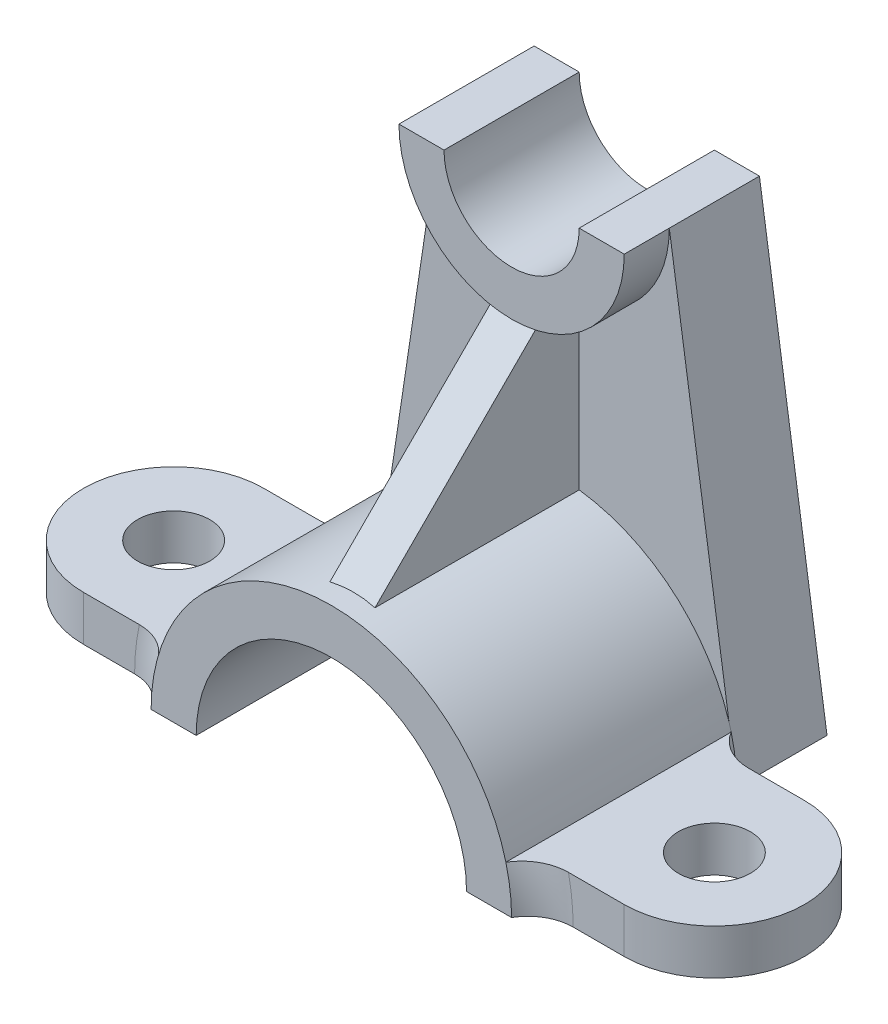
ISO-10303-21;
HEADER;
FILE_DESCRIPTION(('STEP AP214'),'2;1');
FILE_NAME('part.step','',(''),(''),'','','');
FILE_SCHEMA(('AUTOMOTIVE_DESIGN { 1 0 10303 214 1 1 1 1 }'));
ENDSEC;
DATA;
#1=APPLICATION_CONTEXT('core data for automotive mechanical design processes');
#2=APPLICATION_PROTOCOL_DEFINITION('international standard','automotive_design',2000,#1);
#3=PRODUCT_CONTEXT('',#1,'mechanical');
#4=PRODUCT('Part','Part','',(#3));
#5=PRODUCT_RELATED_PRODUCT_CATEGORY('part','',(#4));
#6=PRODUCT_DEFINITION_FORMATION('','',#4);
#7=PRODUCT_DEFINITION_CONTEXT('part definition',#1,'design');
#8=PRODUCT_DEFINITION('design','',#6,#7);
#9=PRODUCT_DEFINITION_SHAPE('','',#8);
#10=(LENGTH_UNIT() NAMED_UNIT(*) SI_UNIT(.MILLI.,.METRE.));
#11=(NAMED_UNIT(*) PLANE_ANGLE_UNIT() SI_UNIT($,.RADIAN.));
#12=(NAMED_UNIT(*) SI_UNIT($,.STERADIAN.) SOLID_ANGLE_UNIT());
#13=UNCERTAINTY_MEASURE_WITH_UNIT(LENGTH_MEASURE(1.E-05),#10,'distance_accuracy_value','');
#14=(GEOMETRIC_REPRESENTATION_CONTEXT(3) GLOBAL_UNCERTAINTY_ASSIGNED_CONTEXT((#13)) GLOBAL_UNIT_ASSIGNED_CONTEXT((#10,
#11,#12)) REPRESENTATION_CONTEXT('',''));
#15=CARTESIAN_POINT('',(0.,0.,0.));
#16=DIRECTION('',(0.,0.,1.));
#17=DIRECTION('',(1.,0.,0.));
#18=AXIS2_PLACEMENT_3D('',#15,#16,#17);
#19=CARTESIAN_POINT('',(-60.,10.,0.));
#20=DIRECTION('',(0.,1.,0.));
#21=DIRECTION('',(0.,0.,1.));
#22=AXIS2_PLACEMENT_3D('',#19,#20,#21);
#23=CYLINDRICAL_SURFACE('',#22,20.);
#24=DIRECTION('',(0.,1.,0.));
#25=VECTOR('',#24,1.);
#26=CARTESIAN_POINT('',(-60.,0.,20.));
#27=LINE('',#26,#25);
#28=CARTESIAN_POINT('',(-60.,10.,20.));
#29=VERTEX_POINT('',#28);
#30=CARTESIAN_POINT('',(-60.,0.,20.));
#31=VERTEX_POINT('',#30);
#32=EDGE_CURVE('E415',#29,#31,#27,.F.);
#33=ORIENTED_EDGE('',*,*,#32,.F.);
#34=CARTESIAN_POINT('',(-60.,10.,0.));
#35=DIRECTION('',(0.,1.,0.));
#36=DIRECTION('',(-1.,0.,0.));
#37=AXIS2_PLACEMENT_3D('',#34,#35,#36);
#38=CIRCLE('',#37,20.);
#39=CARTESIAN_POINT('',(-60.,10.,-20.));
#40=VERTEX_POINT('',#39);
#41=EDGE_CURVE('E421',#40,#29,#38,.T.);
#42=ORIENTED_EDGE('',*,*,#41,.F.);
#43=DIRECTION('',(0.,-1.,0.));
#44=VECTOR('',#43,1.);
#45=CARTESIAN_POINT('',(-60.,10.,-20.));
#46=LINE('',#45,#44);
#47=CARTESIAN_POINT('',(-60.,0.,-20.));
#48=VERTEX_POINT('',#47);
#49=EDGE_CURVE('E418',#48,#40,#46,.F.);
#50=ORIENTED_EDGE('',*,*,#49,.F.);
#51=CARTESIAN_POINT('',(-60.,0.,0.));
#52=DIRECTION('',(0.,1.,0.));
#53=DIRECTION('',(0.,0.,1.));
#54=AXIS2_PLACEMENT_3D('',#51,#52,#53);
#55=CIRCLE('',#54,20.);
#56=EDGE_CURVE('E423',#31,#48,#55,.F.);
#57=ORIENTED_EDGE('',*,*,#56,.F.);
#58=EDGE_LOOP('',(#33,#42,#50,#57));
#59=FACE_BOUND('',#58,.T.);
#60=ADVANCED_FACE('F34',(#59),#23,.T.);
#61=CARTESIAN_POINT('',(0.,100.,-25.));
#62=DIRECTION('',(0.,0.,-1.));
#63=DIRECTION('',(-1.,0.,0.));
#64=AXIS2_PLACEMENT_3D('',#61,#62,#63);
#65=PLANE('',#64);
#66=DIRECTION('',(0.,-1.,0.));
#67=VECTOR('',#66,1.);
#68=CARTESIAN_POINT('',(-5.,100.,-25.));
#69=LINE('',#68,#67);
#70=CARTESIAN_POINT('',(-5.,75.5051025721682,-25.));
#71=VERTEX_POINT('',#70);
#72=CARTESIAN_POINT('',(-5.,39.6862696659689,-25.));
#73=VERTEX_POINT('',#72);
#74=EDGE_CURVE('E215',#71,#73,#69,.T.);
#75=ORIENTED_EDGE('',*,*,#74,.F.);
#76=CARTESIAN_POINT('',(0.,100.,-25.));
#77=DIRECTION('',(0.,0.,1.));
#78=DIRECTION('',(-1.,0.,0.));
#79=AXIS2_PLACEMENT_3D('',#76,#77,#78);
#80=CIRCLE('',#79,25.);
#81=CARTESIAN_POINT('',(-25.,100.,-25.));
#82=VERTEX_POINT('',#81);
#83=EDGE_CURVE('E285',#82,#71,#80,.T.);
#84=ORIENTED_EDGE('',*,*,#83,.F.);
#85=DIRECTION('',(0.148340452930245,0.988936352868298,0.));
#86=VECTOR('',#85,1.);
#87=CARTESIAN_POINT('',(-40.,0.,-25.));
#88=LINE('',#87,#86);
#89=CARTESIAN_POINT('',(-38.239608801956,11.7359413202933,-25.));
#90=VERTEX_POINT('',#89);
#91=EDGE_CURVE('E296',#90,#82,#88,.T.);
#92=ORIENTED_EDGE('',*,*,#91,.F.);
#93=CARTESIAN_POINT('',(0.,0.,-25.));
#94=DIRECTION('',(0.,0.,-1.));
#95=DIRECTION('',(-1.,0.,0.));
#96=AXIS2_PLACEMENT_3D('',#93,#94,#95);
#97=CIRCLE('',#96,40.);
#98=EDGE_CURVE('E314',#90,#73,#97,.T.);
#99=ORIENTED_EDGE('',*,*,#98,.T.);
#100=EDGE_LOOP('',(#75,#84,#92,#99));
#101=FACE_BOUND('',#100,.T.);
#102=ADVANCED_FACE('F487',(#101),#65,.F.);
#103=CARTESIAN_POINT('',(0.,100.,-15.));
#104=DIRECTION('',(0.,0.,-1.));
#105=DIRECTION('',(-1.,0.,0.));
#106=AXIS2_PLACEMENT_3D('',#103,#104,#105);
#107=CYLINDRICAL_SURFACE('',#106,25.);
#108=DIRECTION('',(0.,0.,-1.));
#109=VECTOR('',#108,1.);
#110=CARTESIAN_POINT('',(5.,75.5051025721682,-15.));
#111=LINE('',#110,#109);
#112=CARTESIAN_POINT('',(5.,75.5051025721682,-25.));
#113=VERTEX_POINT('',#112);
#114=CARTESIAN_POINT('',(5.,75.5051025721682,-15.5051025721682));
#115=VERTEX_POINT('',#114);
#116=EDGE_CURVE('E219',#113,#115,#111,.F.);
#117=ORIENTED_EDGE('',*,*,#116,.F.);
#118=CARTESIAN_POINT('',(25.,100.,-25.));
#119=VERTEX_POINT('',#118);
#120=EDGE_CURVE('E300',#113,#119,#80,.T.);
#121=ORIENTED_EDGE('',*,*,#120,.T.);
#122=DIRECTION('',(0.,0.,-1.));
#123=VECTOR('',#122,1.);
#124=CARTESIAN_POINT('',(25.,100.,-15.));
#125=LINE('',#124,#123);
#126=CARTESIAN_POINT('',(25.,100.,-15.));
#127=VERTEX_POINT('',#126);
#128=EDGE_CURVE('E270',#127,#119,#125,.T.);
#129=ORIENTED_EDGE('',*,*,#128,.F.);
#130=CARTESIAN_POINT('',(0.,100.,-15.));
#131=DIRECTION('',(0.,0.,-1.));
#132=DIRECTION('',(-1.,0.,0.));
#133=AXIS2_PLACEMENT_3D('',#130,#131,#132);
#134=CIRCLE('',#133,25.);
#135=CARTESIAN_POINT('',(0.,75.,-15.));
#136=VERTEX_POINT('',#135);
#137=EDGE_CURVE('E250',#127,#136,#134,.T.);
#138=ORIENTED_EDGE('',*,*,#137,.T.);
#139=CARTESIAN_POINT('',(0.,100.,-40.));
#140=DIRECTION('',(0.,0.707106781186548,0.707106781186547));
#141=DIRECTION('',(0.,0.707106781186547,-0.707106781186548));
#142=AXIS2_PLACEMENT_3D('',#139,#140,#141);
#143=ELLIPSE('',#142,35.3553390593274,25.);
#144=EDGE_CURVE('E238',#115,#136,#143,.F.);
#145=ORIENTED_EDGE('',*,*,#144,.F.);
#146=EDGE_LOOP('',(#117,#121,#129,#138,#145));
#147=FACE_BOUND('',#146,.T.);
#148=ADVANCED_FACE('F478',(#147),#107,.T.);
#149=CARTESIAN_POINT('',(0.,0.,-25.));
#150=DIRECTION('',(0.,0.,1.));
#151=DIRECTION('',(1.,0.,0.));
#152=AXIS2_PLACEMENT_3D('',#149,#150,#151);
#153=PLANE('',#152);
#154=DIRECTION('',(0.148340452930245,-0.988936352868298,0.));
#155=VECTOR('',#154,1.);
#156=CARTESIAN_POINT('',(40.,0.,-25.));
#157=LINE('',#156,#155);
#158=CARTESIAN_POINT('',(38.239608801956,11.7359413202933,-25.));
#159=VERTEX_POINT('',#158);
#160=CARTESIAN_POINT('',(40.,0.,-25.));
#161=VERTEX_POINT('',#160);
#162=EDGE_CURVE('E273',#159,#161,#157,.T.);
#163=ORIENTED_EDGE('',*,*,#162,.F.);
#164=CARTESIAN_POINT('',(0.,0.,-25.));
#165=DIRECTION('',(0.,0.,1.));
#166=DIRECTION('',(1.,0.,0.));
#167=AXIS2_PLACEMENT_3D('',#164,#165,#166);
#168=CIRCLE('',#167,40.);
#169=CARTESIAN_POINT('',(38.7298334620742,10.,-25.));
#170=VERTEX_POINT('',#169);
#171=EDGE_CURVE('E352',#170,#159,#168,.T.);
#172=ORIENTED_EDGE('',*,*,#171,.F.);
#173=EDGE_CURVE('E348',#161,#170,#168,.T.);
#174=ORIENTED_EDGE('',*,*,#173,.F.);
#175=EDGE_LOOP('',(#163,#172,#174));
#176=FACE_BOUND('',#175,.T.);
#177=ADVANCED_FACE('F584',(#176),#153,.F.);
#178=CARTESIAN_POINT('',(-40.,0.,-25.));
#179=VERTEX_POINT('',#178);
#180=EDGE_CURVE('E297',#179,#90,#88,.T.);
#181=ORIENTED_EDGE('',*,*,#180,.F.);
#182=CARTESIAN_POINT('',(-38.7298334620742,10.,-25.));
#183=VERTEX_POINT('',#182);
#184=EDGE_CURVE('E334',#183,#179,#168,.T.);
#185=ORIENTED_EDGE('',*,*,#184,.F.);
#186=EDGE_CURVE('E553',#90,#183,#168,.T.);
#187=ORIENTED_EDGE('',*,*,#186,.F.);
#188=EDGE_LOOP('',(#181,#185,#187));
#189=FACE_BOUND('',#188,.T.);
#190=ADVANCED_FACE('F557',(#189),#153,.F.);
#191=CARTESIAN_POINT('',(60.,0.,0.));
#192=DIRECTION('',(0.,1.,0.));
#193=DIRECTION('',(0.,0.,1.));
#194=AXIS2_PLACEMENT_3D('',#191,#192,#193);
#195=CYLINDRICAL_SURFACE('',#194,20.);
#196=DIRECTION('',(0.,-1.,0.));
#197=VECTOR('',#196,1.);
#198=CARTESIAN_POINT('',(60.,0.,20.));
#199=LINE('',#198,#197);
#200=CARTESIAN_POINT('',(60.,0.,20.));
#201=VERTEX_POINT('',#200);
#202=CARTESIAN_POINT('',(60.,10.,20.));
#203=VERTEX_POINT('',#202);
#204=EDGE_CURVE('E359',#201,#203,#199,.F.);
#205=ORIENTED_EDGE('',*,*,#204,.F.);
#206=CARTESIAN_POINT('',(60.,0.,0.));
#207=DIRECTION('',(0.,1.,0.));
#208=DIRECTION('',(0.,0.,1.));
#209=AXIS2_PLACEMENT_3D('',#206,#207,#208);
#210=CIRCLE('',#209,20.);
#211=CARTESIAN_POINT('',(60.,0.,-20.));
#212=VERTEX_POINT('',#211);
#213=EDGE_CURVE('E365',#212,#201,#210,.F.);
#214=ORIENTED_EDGE('',*,*,#213,.F.);
#215=DIRECTION('',(0.,1.,0.));
#216=VECTOR('',#215,1.);
#217=CARTESIAN_POINT('',(60.,0.,-20.));
#218=LINE('',#217,#216);
#219=CARTESIAN_POINT('',(60.,10.,-20.));
#220=VERTEX_POINT('',#219);
#221=EDGE_CURVE('E362',#220,#212,#218,.F.);
#222=ORIENTED_EDGE('',*,*,#221,.F.);
#223=CARTESIAN_POINT('',(60.,10.,0.));
#224=DIRECTION('',(0.,-1.,0.));
#225=DIRECTION('',(1.,0.,0.));
#226=AXIS2_PLACEMENT_3D('',#223,#224,#225);
#227=CIRCLE('',#226,20.);
#228=EDGE_CURVE('E368',#203,#220,#227,.F.);
#229=ORIENTED_EDGE('',*,*,#228,.F.);
#230=EDGE_LOOP('',(#205,#214,#222,#229));
#231=FACE_BOUND('',#230,.T.);
#232=ADVANCED_FACE('F401',(#231),#195,.T.);
#233=CARTESIAN_POINT('',(0.,0.,25.));
#234=DIRECTION('',(0.,0.,-1.));
#235=DIRECTION('',(-1.,0.,0.));
#236=AXIS2_PLACEMENT_3D('',#233,#234,#235);
#237=CYLINDRICAL_SURFACE('',#236,40.);
#238=ORIENTED_EDGE('',*,*,#186,.T.);
#239=DIRECTION('',(0.,0.,-1.));
#240=VECTOR('',#239,1.);
#241=CARTESIAN_POINT('',(-38.7298334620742,10.,20.));
#242=LINE('',#241,#240);
#243=CARTESIAN_POINT('',(-38.7298334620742,10.,25.));
#244=VERTEX_POINT('',#243);
#245=EDGE_CURVE('E230',#244,#183,#242,.T.);
#246=ORIENTED_EDGE('',*,*,#245,.F.);
#247=CARTESIAN_POINT('',(0.,0.,25.));
#248=DIRECTION('',(0.,0.,1.));
#249=DIRECTION('',(1.,0.,0.));
#250=AXIS2_PLACEMENT_3D('',#247,#248,#249);
#251=CIRCLE('',#250,40.);
#252=CARTESIAN_POINT('',(38.7298334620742,10.,25.));
#253=VERTEX_POINT('',#252);
#254=EDGE_CURVE('E339',#253,#244,#251,.T.);
#255=ORIENTED_EDGE('',*,*,#254,.F.);
#256=DIRECTION('',(0.,0.,-1.));
#257=VECTOR('',#256,1.);
#258=CARTESIAN_POINT('',(38.7298334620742,10.,20.));
#259=LINE('',#258,#257);
#260=EDGE_CURVE('E329',#253,#170,#259,.T.);
#261=ORIENTED_EDGE('',*,*,#260,.T.);
#262=ORIENTED_EDGE('',*,*,#171,.T.);
#263=CARTESIAN_POINT('',(5.,39.6862696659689,-25.));
#264=VERTEX_POINT('',#263);
#265=EDGE_CURVE('E313',#264,#159,#97,.T.);
#266=ORIENTED_EDGE('',*,*,#265,.F.);
#267=DIRECTION('',(0.,0.,-1.));
#268=VECTOR('',#267,1.);
#269=CARTESIAN_POINT('',(5.,39.6862696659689,25.));
#270=LINE('',#269,#268);
#271=CARTESIAN_POINT('',(5.,39.6862696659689,20.3137303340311));
#272=VERTEX_POINT('',#271);
#273=EDGE_CURVE('E236',#264,#272,#270,.F.);
#274=ORIENTED_EDGE('',*,*,#273,.T.);
#275=CARTESIAN_POINT('',(0.,0.,60.));
#276=DIRECTION('',(0.,0.707106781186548,0.707106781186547));
#277=DIRECTION('',(0.,0.707106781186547,-0.707106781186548));
#278=AXIS2_PLACEMENT_3D('',#275,#276,#277);
#279=ELLIPSE('',#278,56.5685424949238,40.);
#280=CARTESIAN_POINT('',(-5.,39.6862696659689,20.3137303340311));
#281=VERTEX_POINT('',#280);
#282=EDGE_CURVE('E224',#272,#281,#279,.T.);
#283=ORIENTED_EDGE('',*,*,#282,.T.);
#284=DIRECTION('',(0.,0.,-1.));
#285=VECTOR('',#284,1.);
#286=CARTESIAN_POINT('',(-5.,39.6862696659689,25.));
#287=LINE('',#286,#285);
#288=EDGE_CURVE('E209',#73,#281,#287,.F.);
#289=ORIENTED_EDGE('',*,*,#288,.F.);
#290=ORIENTED_EDGE('',*,*,#98,.F.);
#291=EDGE_LOOP('',(#238,#246,#255,#261,#262,#266,#274,#283,#289,#290));
#292=FACE_BOUND('',#291,.T.);
#293=ADVANCED_FACE('F234',(#292),#237,.T.);
#294=CARTESIAN_POINT('',(0.,0.,25.));
#295=DIRECTION('',(0.,0.,-1.));
#296=DIRECTION('',(-1.,0.,0.));
#297=AXIS2_PLACEMENT_3D('',#294,#295,#296);
#298=CYLINDRICAL_SURFACE('',#297,30.);
#299=DIRECTION('',(0.,0.,-1.));
#300=VECTOR('',#299,1.);
#301=CARTESIAN_POINT('',(30.,0.,25.));
#302=LINE('',#301,#300);
#303=CARTESIAN_POINT('',(30.,0.,25.));
#304=VERTEX_POINT('',#303);
#305=CARTESIAN_POINT('',(30.,0.,-25.));
#306=VERTEX_POINT('',#305);
#307=EDGE_CURVE('E347',#304,#306,#302,.T.);
#308=ORIENTED_EDGE('',*,*,#307,.F.);
#309=CARTESIAN_POINT('',(0.,0.,25.));
#310=DIRECTION('',(0.,0.,-1.));
#311=DIRECTION('',(1.,0.,0.));
#312=AXIS2_PLACEMENT_3D('',#309,#310,#311);
#313=CIRCLE('',#312,30.);
#314=CARTESIAN_POINT('',(-30.,0.,25.));
#315=VERTEX_POINT('',#314);
#316=EDGE_CURVE('E342',#315,#304,#313,.T.);
#317=ORIENTED_EDGE('',*,*,#316,.F.);
#318=DIRECTION('',(0.,0.,-1.));
#319=VECTOR('',#318,1.);
#320=CARTESIAN_POINT('',(-30.,0.,25.));
#321=LINE('',#320,#319);
#322=CARTESIAN_POINT('',(-30.,0.,-25.));
#323=VERTEX_POINT('',#322);
#324=EDGE_CURVE('E356',#315,#323,#321,.T.);
#325=ORIENTED_EDGE('',*,*,#324,.T.);
#326=CARTESIAN_POINT('',(0.,0.,-25.));
#327=DIRECTION('',(0.,0.,-1.));
#328=DIRECTION('',(1.,0.,0.));
#329=AXIS2_PLACEMENT_3D('',#326,#327,#328);
#330=CIRCLE('',#329,30.);
#331=EDGE_CURVE('E351',#323,#306,#330,.T.);
#332=ORIENTED_EDGE('',*,*,#331,.T.);
#333=EDGE_LOOP('',(#308,#317,#325,#332));
#334=FACE_BOUND('',#333,.T.);
#335=ADVANCED_FACE('F598',(#334),#298,.F.);
#336=CARTESIAN_POINT('',(30.,0.,25.));
#337=DIRECTION('',(0.,1.,0.));
#338=DIRECTION('',(0.,0.,1.));
#339=AXIS2_PLACEMENT_3D('',#336,#337,#338);
#340=PLANE('',#339);
#341=CARTESIAN_POINT('',(-60.,0.,0.));
#342=DIRECTION('',(0.,-1.,0.));
#343=DIRECTION('',(1.,0.,0.));
#344=AXIS2_PLACEMENT_3D('',#341,#342,#343);
#345=CIRCLE('',#344,8.00000000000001);
#346=CARTESIAN_POINT('',(-52.,0.,0.));
#347=VERTEX_POINT('',#346);
#348=EDGE_CURVE('E530',#347,#347,#345,.T.);
#349=ORIENTED_EDGE('',*,*,#348,.F.);
#350=EDGE_LOOP('',(#349));
#351=FACE_BOUND('',#350,.T.);
#352=CARTESIAN_POINT('',(60.,0.,0.));
#353=DIRECTION('',(0.,1.,0.));
#354=DIRECTION('',(-1.,0.,0.));
#355=AXIS2_PLACEMENT_3D('',#352,#353,#354);
#356=CIRCLE('',#355,8.00000000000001);
#357=CARTESIAN_POINT('',(52.,0.,0.));
#358=VERTEX_POINT('',#357);
#359=EDGE_CURVE('E317',#358,#358,#356,.T.);
#360=ORIENTED_EDGE('',*,*,#359,.T.);
#361=EDGE_LOOP('',(#360));
#362=FACE_BOUND('',#361,.T.);
#363=DIRECTION('',(1.,0.,0.));
#364=VECTOR('',#363,1.);
#365=CARTESIAN_POINT('',(-40.,0.,25.));
#366=LINE('',#365,#364);
#367=CARTESIAN_POINT('',(-40.,0.,25.));
#368=VERTEX_POINT('',#367);
#369=EDGE_CURVE('E338',#368,#315,#366,.T.);
#370=ORIENTED_EDGE('',*,*,#369,.F.);
#371=CARTESIAN_POINT('',(-48.6602540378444,0.,30.));
#372=DIRECTION('',(0.,1.,0.));
#373=DIRECTION('',(0.,0.,1.));
#374=AXIS2_PLACEMENT_3D('',#371,#372,#373);
#375=CIRCLE('',#374,10.);
#376=CARTESIAN_POINT('',(-48.6602540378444,0.,20.));
#377=VERTEX_POINT('',#376);
#378=EDGE_CURVE('E48',#368,#377,#375,.T.);
#379=ORIENTED_EDGE('',*,*,#378,.T.);
#380=DIRECTION('',(-1.,0.,0.));
#381=VECTOR('',#380,1.);
#382=CARTESIAN_POINT('',(-40.,0.,20.));
#383=LINE('',#382,#381);
#384=EDGE_CURVE('E519',#377,#31,#383,.T.);
#385=ORIENTED_EDGE('',*,*,#384,.T.);
#386=ORIENTED_EDGE('',*,*,#56,.T.);
#387=DIRECTION('',(-1.,0.,0.));
#388=VECTOR('',#387,1.);
#389=CARTESIAN_POINT('',(-40.,0.,-20.));
#390=LINE('',#389,#388);
#391=CARTESIAN_POINT('',(-48.6602540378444,0.,-20.));
#392=VERTEX_POINT('',#391);
#393=EDGE_CURVE('E520',#392,#48,#390,.T.);
#394=ORIENTED_EDGE('',*,*,#393,.F.);
#395=CARTESIAN_POINT('',(-48.6602540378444,0.,-30.));
#396=DIRECTION('',(0.,1.,0.));
#397=DIRECTION('',(0.,0.,1.));
#398=AXIS2_PLACEMENT_3D('',#395,#396,#397);
#399=CIRCLE('',#398,10.);
#400=EDGE_CURVE('E430',#392,#179,#399,.T.);
#401=ORIENTED_EDGE('',*,*,#400,.T.);
#402=DIRECTION('',(0.,0.,1.));
#403=VECTOR('',#402,1.);
#404=CARTESIAN_POINT('',(-40.,0.,-45.));
#405=LINE('',#404,#403);
#406=CARTESIAN_POINT('',(-40.,0.,-45.));
#407=VERTEX_POINT('',#406);
#408=EDGE_CURVE('E307',#407,#179,#405,.T.);
#409=ORIENTED_EDGE('',*,*,#408,.F.);
#410=DIRECTION('',(-1.,0.,0.));
#411=VECTOR('',#410,1.);
#412=CARTESIAN_POINT('',(40.,0.,-45.));
#413=LINE('',#412,#411);
#414=CARTESIAN_POINT('',(40.,0.,-45.));
#415=VERTEX_POINT('',#414);
#416=EDGE_CURVE('E284',#415,#407,#413,.T.);
#417=ORIENTED_EDGE('',*,*,#416,.F.);
#418=DIRECTION('',(0.,0.,1.));
#419=VECTOR('',#418,1.);
#420=CARTESIAN_POINT('',(40.,0.,-45.));
#421=LINE('',#420,#419);
#422=EDGE_CURVE('E310',#415,#161,#421,.T.);
#423=ORIENTED_EDGE('',*,*,#422,.T.);
#424=CARTESIAN_POINT('',(48.6602540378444,0.,-30.));
#425=DIRECTION('',(0.,1.,0.));
#426=DIRECTION('',(0.,0.,1.));
#427=AXIS2_PLACEMENT_3D('',#424,#425,#426);
#428=CIRCLE('',#427,10.);
#429=CARTESIAN_POINT('',(48.6602540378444,0.,-20.));
#430=VERTEX_POINT('',#429);
#431=EDGE_CURVE('E375',#161,#430,#428,.T.);
#432=ORIENTED_EDGE('',*,*,#431,.T.);
#433=DIRECTION('',(1.,0.,0.));
#434=VECTOR('',#433,1.);
#435=CARTESIAN_POINT('',(40.,0.,-20.));
#436=LINE('',#435,#434);
#437=EDGE_CURVE('E320',#430,#212,#436,.T.);
#438=ORIENTED_EDGE('',*,*,#437,.T.);
#439=ORIENTED_EDGE('',*,*,#213,.T.);
#440=DIRECTION('',(1.,0.,0.));
#441=VECTOR('',#440,1.);
#442=CARTESIAN_POINT('',(40.,0.,20.));
#443=LINE('',#442,#441);
#444=CARTESIAN_POINT('',(48.6602540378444,0.,20.));
#445=VERTEX_POINT('',#444);
#446=EDGE_CURVE('E323',#445,#201,#443,.T.);
#447=ORIENTED_EDGE('',*,*,#446,.F.);
#448=CARTESIAN_POINT('',(48.6602540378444,0.,30.));
#449=DIRECTION('',(0.,1.,0.));
#450=DIRECTION('',(0.,0.,1.));
#451=AXIS2_PLACEMENT_3D('',#448,#449,#450);
#452=CIRCLE('',#451,10.);
#453=CARTESIAN_POINT('',(40.,0.,25.));
#454=VERTEX_POINT('',#453);
#455=EDGE_CURVE('E386',#445,#454,#452,.T.);
#456=ORIENTED_EDGE('',*,*,#455,.T.);
#457=DIRECTION('',(1.,0.,0.));
#458=VECTOR('',#457,1.);
#459=CARTESIAN_POINT('',(30.,0.,25.));
#460=LINE('',#459,#458);
#461=EDGE_CURVE('E344',#304,#454,#460,.T.);
#462=ORIENTED_EDGE('',*,*,#461,.F.);
#463=ORIENTED_EDGE('',*,*,#307,.T.);
#464=DIRECTION('',(-1.,0.,0.));
#465=VECTOR('',#464,1.);
#466=CARTESIAN_POINT('',(40.,0.,-25.));
#467=LINE('',#466,#465);
#468=EDGE_CURVE('E294',#306,#323,#467,.T.);
#469=ORIENTED_EDGE('',*,*,#468,.T.);
#470=ORIENTED_EDGE('',*,*,#324,.F.);
#471=EDGE_LOOP('',(#370,#379,#385,#386,#394,#401,#409,#417,#423,#432,#438,#439,#447,#456,#462,
#463,#469,#470));
#472=FACE_BOUND('',#471,.T.);
#473=ADVANCED_FACE('F565',(#351,#362,#472),#340,.F.);
#474=CARTESIAN_POINT('',(0.,0.,25.));
#475=DIRECTION('',(0.,0.,1.));
#476=DIRECTION('',(1.,0.,0.));
#477=AXIS2_PLACEMENT_3D('',#474,#475,#476);
#478=PLANE('',#477);
#479=ORIENTED_EDGE('',*,*,#316,.T.);
#480=ORIENTED_EDGE('',*,*,#461,.T.);
#481=EDGE_CURVE('E335',#454,#253,#251,.T.);
#482=ORIENTED_EDGE('',*,*,#481,.T.);
#483=ORIENTED_EDGE('',*,*,#254,.T.);
#484=EDGE_CURVE('E340',#244,#368,#251,.T.);
#485=ORIENTED_EDGE('',*,*,#484,.T.);
#486=ORIENTED_EDGE('',*,*,#369,.T.);
#487=EDGE_LOOP('',(#479,#480,#482,#483,#485,#486));
#488=FACE_BOUND('',#487,.T.);
#489=ADVANCED_FACE('F572',(#488),#478,.T.);
#490=CARTESIAN_POINT('',(80.,10.,20.));
#491=DIRECTION('',(0.,-1.,0.));
#492=DIRECTION('',(1.,0.,0.));
#493=AXIS2_PLACEMENT_3D('',#490,#491,#492);
#494=PLANE('',#493);
#495=CARTESIAN_POINT('',(60.,10.,0.));
#496=DIRECTION('',(0.,1.,0.));
#497=DIRECTION('',(-1.,0.,0.));
#498=AXIS2_PLACEMENT_3D('',#495,#496,#497);
#499=CIRCLE('',#498,8.00000000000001);
#500=CARTESIAN_POINT('',(52.,10.,0.));
#501=VERTEX_POINT('',#500);
#502=EDGE_CURVE('E316',#501,#501,#499,.T.);
#503=ORIENTED_EDGE('',*,*,#502,.F.);
#504=EDGE_LOOP('',(#503));
#505=FACE_BOUND('',#504,.T.);
#506=DIRECTION('',(-1.,0.,0.));
#507=VECTOR('',#506,1.);
#508=CARTESIAN_POINT('',(80.,10.,20.));
#509=LINE('',#508,#507);
#510=CARTESIAN_POINT('',(47.6216371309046,10.,20.));
#511=VERTEX_POINT('',#510);
#512=EDGE_CURVE('E325',#203,#511,#509,.T.);
#513=ORIENTED_EDGE('',*,*,#512,.F.);
#514=ORIENTED_EDGE('',*,*,#228,.T.);
#515=DIRECTION('',(-1.,0.,0.));
#516=VECTOR('',#515,1.);
#517=CARTESIAN_POINT('',(80.,10.,-20.));
#518=LINE('',#517,#516);
#519=CARTESIAN_POINT('',(47.6216371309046,10.,-20.));
#520=VERTEX_POINT('',#519);
#521=EDGE_CURVE('E326',#220,#520,#518,.T.);
#522=ORIENTED_EDGE('',*,*,#521,.T.);
#523=CARTESIAN_POINT('',(47.6216371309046,10.,-20.));
#524=CARTESIAN_POINT('',(47.3275635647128,10.,-19.9999725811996));
#525=CARTESIAN_POINT('',(47.0334977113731,10.,-20.01242289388));
#526=CARTESIAN_POINT('',(46.4474700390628,10.,-20.0620205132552));
#527=CARTESIAN_POINT('',(46.155508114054,10.,-20.0991665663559));
#528=CARTESIAN_POINT('',(45.5759581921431,10.,-20.1978612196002));
#529=CARTESIAN_POINT('',(45.2883671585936,10.,-20.2593919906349));
#530=CARTESIAN_POINT('',(44.7193773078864,10.,-20.4064113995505));
#531=CARTESIAN_POINT('',(44.4379784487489,10.,-20.4918998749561));
#532=CARTESIAN_POINT('',(43.883221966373,10.,-20.686310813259));
#533=CARTESIAN_POINT('',(43.6098688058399,10.,-20.7952460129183));
#534=CARTESIAN_POINT('',(43.0732082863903,10.,-21.0358552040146));
#535=CARTESIAN_POINT('',(42.809905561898,10.,-21.1675395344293));
#536=CARTESIAN_POINT('',(42.295507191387,10.,-21.4526919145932));
#537=CARTESIAN_POINT('',(42.0444066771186,10.,-21.6061511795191));
#538=CARTESIAN_POINT('',(41.5562899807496,10.,-21.9338095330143));
#539=CARTESIAN_POINT('',(41.319267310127,10.,-22.1079989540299));
#540=CARTESIAN_POINT('',(40.8558274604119,10.,-22.4801785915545));
#541=CARTESIAN_POINT('',(40.6297696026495,10.,-22.6786166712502));
#542=CARTESIAN_POINT('',(40.1960204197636,10.,-23.0946419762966));
#543=CARTESIAN_POINT('',(39.9883288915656,10.,-23.3122289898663));
#544=CARTESIAN_POINT('',(39.5925441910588,10.,-23.7656411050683));
#545=CARTESIAN_POINT('',(39.4045075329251,10.,-24.0015155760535));
#546=CARTESIAN_POINT('',(39.0503222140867,10.,-24.4892347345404));
#547=CARTESIAN_POINT('',(38.8841782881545,10.,-24.7410828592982));
#548=CARTESIAN_POINT('',(38.7298334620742,10.,-25.));
#549=B_SPLINE_CURVE_WITH_KNOTS('',3,(#523,#524,#525,#526,#527,#528,#529,#530,#531,#532,#533,
#534,#535,#536,#537,#538,#539,#540,#541,#542,#543,#544,#545,#546,#547,#548),.UNSPECIFIED.,.F.,
.F.,(4,2,2,2,2,2,2,2,2,2,2,2,4),(0.,0.881946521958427,1.76384827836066,2.64510641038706,
3.52635856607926,4.40809065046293,5.29022452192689,6.17200351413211,7.05337288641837,
7.95460227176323,8.85582169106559,9.75956497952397,10.6635034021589),.UNSPECIFIED.);
#550=EDGE_CURVE('E377',#520,#170,#549,.T.);
#551=ORIENTED_EDGE('',*,*,#550,.T.);
#552=ORIENTED_EDGE('',*,*,#260,.F.);
#553=CARTESIAN_POINT('',(38.7298334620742,10.,25.));
#554=CARTESIAN_POINT('',(38.8768130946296,10.,24.7534474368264));
#555=CARTESIAN_POINT('',(39.0344881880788,10.,24.5132998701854));
#556=CARTESIAN_POINT('',(39.3697661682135,10.,24.0474146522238));
#557=CARTESIAN_POINT('',(39.5473649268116,10.,23.821674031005));
#558=CARTESIAN_POINT('',(39.9206019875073,10.,23.3866670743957));
#559=CARTESIAN_POINT('',(40.1161920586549,10.,23.1773593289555));
#560=CARTESIAN_POINT('',(40.5242729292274,10.,22.7759168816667));
#561=CARTESIAN_POINT('',(40.7367642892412,10.,22.5837827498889));
#562=CARTESIAN_POINT('',(41.1769775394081,10.,22.2179742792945));
#563=CARTESIAN_POINT('',(41.4046951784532,10.,22.0442948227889));
#564=CARTESIAN_POINT('',(41.8738510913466,10.,21.7163510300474));
#565=CARTESIAN_POINT('',(42.1152953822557,10.,21.5620953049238));
#566=CARTESIAN_POINT('',(42.6102602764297,10.,21.2739519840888));
#567=CARTESIAN_POINT('',(42.8637887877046,10.,21.1400779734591));
#568=CARTESIAN_POINT('',(43.380892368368,10.,20.8937049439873));
#569=CARTESIAN_POINT('',(43.6444633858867,10.,20.7811974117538));
#570=CARTESIAN_POINT('',(44.2074399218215,10.,20.5677750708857));
#571=CARTESIAN_POINT('',(44.507748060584,10.,20.4692329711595));
#572=CARTESIAN_POINT('',(45.1160624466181,10.,20.2996699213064));
#573=CARTESIAN_POINT('',(45.4240695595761,10.,20.2286520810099));
#574=CARTESIAN_POINT('',(46.0457021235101,10.,20.1146504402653));
#575=CARTESIAN_POINT('',(46.3593351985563,10.,20.0717081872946));
#576=CARTESIAN_POINT('',(46.9891881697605,10.,20.0143649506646));
#577=CARTESIAN_POINT('',(47.3054079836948,10.,19.9999630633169));
#578=CARTESIAN_POINT('',(47.6216371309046,10.,20.));
#579=B_SPLINE_CURVE_WITH_KNOTS('',3,(#553,#554,#555,#556,#557,#558,#559,#560,#561,#562,#563,
#564,#565,#566,#567,#568,#569,#570,#571,#572,#573,#574,#575,#576,#577,#578),.UNSPECIFIED.,.F.,
.F.,(4,2,2,2,2,2,2,2,2,2,2,2,4),(0.,0.860812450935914,1.72144687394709,2.57983785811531,
3.43825732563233,4.29643811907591,5.15499803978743,6.01412773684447,6.87291439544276,
7.81978670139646,8.76676595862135,9.71514344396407,10.663490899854),.UNSPECIFIED.);
#580=EDGE_CURVE('E409',#253,#511,#579,.T.);
#581=ORIENTED_EDGE('',*,*,#580,.T.);
#582=EDGE_LOOP('',(#513,#514,#522,#551,#552,#581));
#583=FACE_BOUND('',#582,.T.);
#584=ADVANCED_FACE('F388',(#505,#583),#494,.F.);
#585=CARTESIAN_POINT('',(0.,0.,20.));
#586=DIRECTION('',(0.,0.,1.));
#587=DIRECTION('',(1.,0.,0.));
#588=AXIS2_PLACEMENT_3D('',#585,#586,#587);
#589=PLANE('',#588);
#590=ORIENTED_EDGE('',*,*,#512,.T.);
#591=CARTESIAN_POINT('',(0.,0.,20.));
#592=DIRECTION('',(0.,0.,1.));
#593=DIRECTION('',(1.,0.,0.));
#594=AXIS2_PLACEMENT_3D('',#591,#592,#593);
#595=CIRCLE('',#594,48.6602540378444);
#596=EDGE_CURVE('E372',#511,#445,#595,.F.);
#597=ORIENTED_EDGE('',*,*,#596,.T.);
#598=ORIENTED_EDGE('',*,*,#446,.T.);
#599=ORIENTED_EDGE('',*,*,#204,.T.);
#600=EDGE_LOOP('',(#590,#597,#598,#599));
#601=FACE_BOUND('',#600,.T.);
#602=ADVANCED_FACE('F499',(#601),#589,.T.);
#603=CARTESIAN_POINT('',(0.,0.,-20.));
#604=DIRECTION('',(0.,0.,1.));
#605=DIRECTION('',(1.,0.,0.));
#606=AXIS2_PLACEMENT_3D('',#603,#604,#605);
#607=PLANE('',#606);
#608=ORIENTED_EDGE('',*,*,#437,.F.);
#609=CARTESIAN_POINT('',(0.,0.,-20.));
#610=DIRECTION('',(0.,0.,1.));
#611=DIRECTION('',(1.,0.,0.));
#612=AXIS2_PLACEMENT_3D('',#609,#610,#611);
#613=CIRCLE('',#612,48.6602540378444);
#614=EDGE_CURVE('E370',#430,#520,#613,.T.);
#615=ORIENTED_EDGE('',*,*,#614,.T.);
#616=ORIENTED_EDGE('',*,*,#521,.F.);
#617=ORIENTED_EDGE('',*,*,#221,.T.);
#618=EDGE_LOOP('',(#608,#615,#616,#617));
#619=FACE_BOUND('',#618,.T.);
#620=ADVANCED_FACE('F398',(#619),#607,.F.);
#621=CARTESIAN_POINT('',(0.,0.,-30.));
#622=DIRECTION('',(0.,0.,1.));
#623=DIRECTION('',(1.,0.,0.));
#624=AXIS2_PLACEMENT_3D('',#621,#622,#623);
#625=TOROIDAL_SURFACE('',#624,48.6602540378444,10.);
#626=ORIENTED_EDGE('',*,*,#550,.F.);
#627=ORIENTED_EDGE('',*,*,#614,.F.);
#628=ORIENTED_EDGE('',*,*,#431,.F.);
#629=ORIENTED_EDGE('',*,*,#173,.T.);
#630=EDGE_LOOP('',(#626,#627,#628,#629));
#631=FACE_BOUND('',#630,.T.);
#632=ADVANCED_FACE('F392',(#631),#625,.F.);
#633=CARTESIAN_POINT('',(0.,0.,30.));
#634=DIRECTION('',(0.,0.,1.));
#635=DIRECTION('',(1.,0.,0.));
#636=AXIS2_PLACEMENT_3D('',#633,#634,#635);
#637=TOROIDAL_SURFACE('',#636,48.6602540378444,10.);
#638=ORIENTED_EDGE('',*,*,#580,.F.);
#639=ORIENTED_EDGE('',*,*,#481,.F.);
#640=ORIENTED_EDGE('',*,*,#455,.F.);
#641=ORIENTED_EDGE('',*,*,#596,.F.);
#642=EDGE_LOOP('',(#638,#639,#640,#641));
#643=FACE_BOUND('',#642,.T.);
#644=ADVANCED_FACE('F397',(#643),#637,.F.);
#645=CARTESIAN_POINT('',(60.,0.,0.));
#646=DIRECTION('',(0.,1.,0.));
#647=DIRECTION('',(-1.,0.,0.));
#648=AXIS2_PLACEMENT_3D('',#645,#646,#647);
#649=CYLINDRICAL_SURFACE('',#648,8.00000000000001);
#650=ORIENTED_EDGE('',*,*,#359,.F.);
#651=EDGE_LOOP('',(#650));
#652=FACE_BOUND('',#651,.T.);
#653=ORIENTED_EDGE('',*,*,#502,.T.);
#654=EDGE_LOOP('',(#653));
#655=FACE_BOUND('',#654,.T.);
#656=ADVANCED_FACE('F406',(#652,#655),#649,.F.);
#657=ORIENTED_EDGE('',*,*,#120,.F.);
#658=DIRECTION('',(0.,-1.,0.));
#659=VECTOR('',#658,1.);
#660=CARTESIAN_POINT('',(5.,100.,-25.));
#661=LINE('',#660,#659);
#662=EDGE_CURVE('E245',#113,#264,#661,.T.);
#663=ORIENTED_EDGE('',*,*,#662,.T.);
#664=ORIENTED_EDGE('',*,*,#265,.T.);
#665=EDGE_CURVE('E291',#119,#159,#157,.T.);
#666=ORIENTED_EDGE('',*,*,#665,.F.);
#667=EDGE_LOOP('',(#657,#663,#664,#666));
#668=FACE_BOUND('',#667,.T.);
#669=ADVANCED_FACE('F488',(#668),#65,.F.);
#670=CARTESIAN_POINT('',(40.,0.,-45.));
#671=DIRECTION('',(-0.988936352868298,-0.148340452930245,0.));
#672=DIRECTION('',(0.148340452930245,-0.988936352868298,0.));
#673=AXIS2_PLACEMENT_3D('',#670,#671,#672);
#674=PLANE('',#673);
#675=ORIENTED_EDGE('',*,*,#665,.T.);
#676=ORIENTED_EDGE('',*,*,#162,.T.);
#677=ORIENTED_EDGE('',*,*,#422,.F.);
#678=DIRECTION('',(0.148340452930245,-0.988936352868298,0.));
#679=VECTOR('',#678,1.);
#680=CARTESIAN_POINT('',(40.,0.,-45.));
#681=LINE('',#680,#679);
#682=CARTESIAN_POINT('',(25.,100.,-45.));
#683=VERTEX_POINT('',#682);
#684=EDGE_CURVE('E281',#683,#415,#681,.T.);
#685=ORIENTED_EDGE('',*,*,#684,.F.);
#686=DIRECTION('',(0.,0.,1.));
#687=VECTOR('',#686,1.);
#688=CARTESIAN_POINT('',(25.,100.,-45.));
#689=LINE('',#688,#687);
#690=EDGE_CURVE('E290',#683,#119,#689,.T.);
#691=ORIENTED_EDGE('',*,*,#690,.T.);
#692=EDGE_LOOP('',(#675,#676,#677,#685,#691));
#693=FACE_BOUND('',#692,.T.);
#694=ADVANCED_FACE('F491',(#693),#674,.F.);
#695=CARTESIAN_POINT('',(-40.,0.,-45.));
#696=DIRECTION('',(0.988936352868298,-0.148340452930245,0.));
#697=DIRECTION('',(0.148340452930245,0.988936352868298,0.));
#698=AXIS2_PLACEMENT_3D('',#695,#696,#697);
#699=PLANE('',#698);
#700=ORIENTED_EDGE('',*,*,#180,.T.);
#701=ORIENTED_EDGE('',*,*,#91,.T.);
#702=DIRECTION('',(0.,0.,1.));
#703=VECTOR('',#702,1.);
#704=CARTESIAN_POINT('',(-25.,100.,-45.));
#705=LINE('',#704,#703);
#706=CARTESIAN_POINT('',(-25.,100.,-45.));
#707=VERTEX_POINT('',#706);
#708=EDGE_CURVE('E305',#707,#82,#705,.T.);
#709=ORIENTED_EDGE('',*,*,#708,.F.);
#710=DIRECTION('',(0.148340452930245,0.988936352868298,0.));
#711=VECTOR('',#710,1.);
#712=CARTESIAN_POINT('',(-40.,0.,-45.));
#713=LINE('',#712,#711);
#714=EDGE_CURVE('E287',#407,#707,#713,.T.);
#715=ORIENTED_EDGE('',*,*,#714,.F.);
#716=ORIENTED_EDGE('',*,*,#408,.T.);
#717=EDGE_LOOP('',(#700,#701,#709,#715,#716));
#718=FACE_BOUND('',#717,.T.);
#719=ADVANCED_FACE('F482',(#718),#699,.F.);
#720=CARTESIAN_POINT('',(0.,100.,-45.));
#721=DIRECTION('',(0.,0.,-1.));
#722=DIRECTION('',(-1.,0.,0.));
#723=AXIS2_PLACEMENT_3D('',#720,#721,#722);
#724=PLANE('',#723);
#725=ORIENTED_EDGE('',*,*,#416,.T.);
#726=ORIENTED_EDGE('',*,*,#714,.T.);
#727=DIRECTION('',(1.,0.,0.));
#728=VECTOR('',#727,1.);
#729=CARTESIAN_POINT('',(-15.,100.,-45.));
#730=LINE('',#729,#728);
#731=CARTESIAN_POINT('',(-15.,100.,-45.));
#732=VERTEX_POINT('',#731);
#733=EDGE_CURVE('E249',#707,#732,#730,.T.);
#734=ORIENTED_EDGE('',*,*,#733,.T.);
#735=CARTESIAN_POINT('',(0.,100.,-45.));
#736=DIRECTION('',(0.,0.,1.));
#737=DIRECTION('',(-1.,0.,0.));
#738=AXIS2_PLACEMENT_3D('',#735,#736,#737);
#739=CIRCLE('',#738,15.);
#740=CARTESIAN_POINT('',(15.,100.,-45.));
#741=VERTEX_POINT('',#740);
#742=EDGE_CURVE('E266',#732,#741,#739,.T.);
#743=ORIENTED_EDGE('',*,*,#742,.T.);
#744=DIRECTION('',(1.,0.,0.));
#745=VECTOR('',#744,1.);
#746=CARTESIAN_POINT('',(25.,100.,-45.));
#747=LINE('',#746,#745);
#748=EDGE_CURVE('E268',#741,#683,#747,.T.);
#749=ORIENTED_EDGE('',*,*,#748,.T.);
#750=ORIENTED_EDGE('',*,*,#684,.T.);
#751=EDGE_LOOP('',(#725,#726,#734,#743,#749,#750));
#752=FACE_BOUND('',#751,.T.);
#753=ADVANCED_FACE('F479',(#752),#724,.T.);
#754=ORIENTED_EDGE('',*,*,#468,.F.);
#755=ORIENTED_EDGE('',*,*,#331,.F.);
#756=EDGE_LOOP('',(#754,#755));
#757=FACE_BOUND('',#756,.T.);
#758=ADVANCED_FACE('F476',(#757),#65,.F.);
#759=CARTESIAN_POINT('',(-5.,75.5051025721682,-15.5051025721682));
#760=VERTEX_POINT('',#759);
#761=EDGE_CURVE('E227',#136,#760,#143,.F.);
#762=ORIENTED_EDGE('',*,*,#761,.F.);
#763=CARTESIAN_POINT('',(-25.,100.,-15.));
#764=VERTEX_POINT('',#763);
#765=EDGE_CURVE('E254',#136,#764,#134,.T.);
#766=ORIENTED_EDGE('',*,*,#765,.T.);
#767=DIRECTION('',(0.,0.,-1.));
#768=VECTOR('',#767,1.);
#769=CARTESIAN_POINT('',(-25.,100.,-15.));
#770=LINE('',#769,#768);
#771=EDGE_CURVE('E263',#764,#82,#770,.T.);
#772=ORIENTED_EDGE('',*,*,#771,.T.);
#773=ORIENTED_EDGE('',*,*,#83,.T.);
#774=DIRECTION('',(0.,0.,-1.));
#775=VECTOR('',#774,1.);
#776=CARTESIAN_POINT('',(-5.,75.5051025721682,-15.));
#777=LINE('',#776,#775);
#778=EDGE_CURVE('E237',#71,#760,#777,.F.);
#779=ORIENTED_EDGE('',*,*,#778,.T.);
#780=EDGE_LOOP('',(#762,#766,#772,#773,#779));
#781=FACE_BOUND('',#780,.T.);
#782=ADVANCED_FACE('F466',(#781),#107,.T.);
#783=CARTESIAN_POINT('',(25.,100.,-15.));
#784=DIRECTION('',(0.,1.,0.));
#785=DIRECTION('',(0.,0.,1.));
#786=AXIS2_PLACEMENT_3D('',#783,#784,#785);
#787=PLANE('',#786);
#788=ORIENTED_EDGE('',*,*,#748,.F.);
#789=DIRECTION('',(0.,0.,-1.));
#790=VECTOR('',#789,1.);
#791=CARTESIAN_POINT('',(15.,100.,-15.));
#792=LINE('',#791,#790);
#793=CARTESIAN_POINT('',(15.,100.,-15.));
#794=VERTEX_POINT('',#793);
#795=EDGE_CURVE('E274',#794,#741,#792,.T.);
#796=ORIENTED_EDGE('',*,*,#795,.F.);
#797=DIRECTION('',(1.,0.,0.));
#798=VECTOR('',#797,1.);
#799=CARTESIAN_POINT('',(25.,100.,-15.));
#800=LINE('',#799,#798);
#801=EDGE_CURVE('E260',#794,#127,#800,.T.);
#802=ORIENTED_EDGE('',*,*,#801,.T.);
#803=ORIENTED_EDGE('',*,*,#128,.T.);
#804=ORIENTED_EDGE('',*,*,#690,.F.);
#805=EDGE_LOOP('',(#788,#796,#802,#803,#804));
#806=FACE_BOUND('',#805,.T.);
#807=ADVANCED_FACE('F462',(#806),#787,.T.);
#808=CARTESIAN_POINT('',(0.,100.,-15.));
#809=DIRECTION('',(0.,0.,-1.));
#810=DIRECTION('',(-1.,0.,0.));
#811=AXIS2_PLACEMENT_3D('',#808,#809,#810);
#812=CYLINDRICAL_SURFACE('',#811,15.);
#813=ORIENTED_EDGE('',*,*,#795,.T.);
#814=ORIENTED_EDGE('',*,*,#742,.F.);
#815=DIRECTION('',(0.,0.,-1.));
#816=VECTOR('',#815,1.);
#817=CARTESIAN_POINT('',(-15.,100.,-15.));
#818=LINE('',#817,#816);
#819=CARTESIAN_POINT('',(-15.,100.,-15.));
#820=VERTEX_POINT('',#819);
#821=EDGE_CURVE('E277',#820,#732,#818,.T.);
#822=ORIENTED_EDGE('',*,*,#821,.F.);
#823=CARTESIAN_POINT('',(0.,100.,-15.));
#824=DIRECTION('',(0.,0.,1.));
#825=DIRECTION('',(-1.,0.,0.));
#826=AXIS2_PLACEMENT_3D('',#823,#824,#825);
#827=CIRCLE('',#826,15.);
#828=EDGE_CURVE('E257',#820,#794,#827,.T.);
#829=ORIENTED_EDGE('',*,*,#828,.T.);
#830=EDGE_LOOP('',(#813,#814,#822,#829));
#831=FACE_BOUND('',#830,.T.);
#832=ADVANCED_FACE('F465',(#831),#812,.F.);
#833=CARTESIAN_POINT('',(-15.,100.,-15.));
#834=DIRECTION('',(0.,1.,0.));
#835=DIRECTION('',(0.,0.,1.));
#836=AXIS2_PLACEMENT_3D('',#833,#834,#835);
#837=PLANE('',#836);
#838=ORIENTED_EDGE('',*,*,#733,.F.);
#839=ORIENTED_EDGE('',*,*,#708,.T.);
#840=ORIENTED_EDGE('',*,*,#771,.F.);
#841=DIRECTION('',(1.,0.,0.));
#842=VECTOR('',#841,1.);
#843=CARTESIAN_POINT('',(-15.,100.,-15.));
#844=LINE('',#843,#842);
#845=EDGE_CURVE('E253',#764,#820,#844,.T.);
#846=ORIENTED_EDGE('',*,*,#845,.T.);
#847=ORIENTED_EDGE('',*,*,#821,.T.);
#848=EDGE_LOOP('',(#838,#839,#840,#846,#847));
#849=FACE_BOUND('',#848,.T.);
#850=ADVANCED_FACE('F460',(#849),#837,.T.);
#851=CARTESIAN_POINT('',(0.,100.,-15.));
#852=DIRECTION('',(0.,0.,-1.));
#853=DIRECTION('',(-1.,0.,0.));
#854=AXIS2_PLACEMENT_3D('',#851,#852,#853);
#855=PLANE('',#854);
#856=ORIENTED_EDGE('',*,*,#137,.F.);
#857=ORIENTED_EDGE('',*,*,#801,.F.);
#858=ORIENTED_EDGE('',*,*,#828,.F.);
#859=ORIENTED_EDGE('',*,*,#845,.F.);
#860=ORIENTED_EDGE('',*,*,#765,.F.);
#861=EDGE_LOOP('',(#856,#857,#858,#859,#860));
#862=FACE_BOUND('',#861,.T.);
#863=ADVANCED_FACE('F452',(#862),#855,.F.);
#864=CARTESIAN_POINT('',(5.,50.,-9.66015402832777));
#865=DIRECTION('',(1.,0.,0.));
#866=DIRECTION('',(0.,0.,-1.));
#867=AXIS2_PLACEMENT_3D('',#864,#865,#866);
#868=PLANE('',#867);
#869=ORIENTED_EDGE('',*,*,#273,.F.);
#870=ORIENTED_EDGE('',*,*,#662,.F.);
#871=ORIENTED_EDGE('',*,*,#116,.T.);
#872=DIRECTION('',(0.,-0.707106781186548,0.707106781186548));
#873=VECTOR('',#872,1.);
#874=CARTESIAN_POINT('',(5.,75.,-15.));
#875=LINE('',#874,#873);
#876=EDGE_CURVE('E229',#115,#272,#875,.T.);
#877=ORIENTED_EDGE('',*,*,#876,.T.);
#878=EDGE_LOOP('',(#869,#870,#871,#877));
#879=FACE_BOUND('',#878,.T.);
#880=ADVANCED_FACE('F448',(#879),#868,.T.);
#881=CARTESIAN_POINT('',(-5.,50.,-9.66015402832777));
#882=DIRECTION('',(1.,0.,0.));
#883=DIRECTION('',(0.,0.,-1.));
#884=AXIS2_PLACEMENT_3D('',#881,#882,#883);
#885=PLANE('',#884);
#886=ORIENTED_EDGE('',*,*,#74,.T.);
#887=ORIENTED_EDGE('',*,*,#288,.T.);
#888=DIRECTION('',(0.,-0.707106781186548,0.707106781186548));
#889=VECTOR('',#888,1.);
#890=CARTESIAN_POINT('',(-5.,75.,-15.));
#891=LINE('',#890,#889);
#892=EDGE_CURVE('E212',#760,#281,#891,.T.);
#893=ORIENTED_EDGE('',*,*,#892,.F.);
#894=ORIENTED_EDGE('',*,*,#778,.F.);
#895=EDGE_LOOP('',(#886,#887,#893,#894));
#896=FACE_BOUND('',#895,.T.);
#897=ADVANCED_FACE('F211',(#896),#885,.F.);
#898=CARTESIAN_POINT('',(0.,75.,-15.));
#899=DIRECTION('',(0.,0.707106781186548,0.707106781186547));
#900=DIRECTION('',(0.,-0.707106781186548,0.707106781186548));
#901=AXIS2_PLACEMENT_3D('',#898,#899,#900);
#902=PLANE('',#901);
#903=ORIENTED_EDGE('',*,*,#282,.F.);
#904=ORIENTED_EDGE('',*,*,#876,.F.);
#905=ORIENTED_EDGE('',*,*,#144,.T.);
#906=ORIENTED_EDGE('',*,*,#761,.T.);
#907=ORIENTED_EDGE('',*,*,#892,.T.);
#908=EDGE_LOOP('',(#903,#904,#905,#906,#907));
#909=FACE_BOUND('',#908,.T.);
#910=ADVANCED_FACE('F222',(#909),#902,.T.);
#911=CARTESIAN_POINT('',(-80.,10.,20.));
#912=DIRECTION('',(0.,1.,0.));
#913=DIRECTION('',(-1.,0.,0.));
#914=AXIS2_PLACEMENT_3D('',#911,#912,#913);
#915=PLANE('',#914);
#916=CARTESIAN_POINT('',(-60.,10.,0.));
#917=DIRECTION('',(0.,-1.,0.));
#918=DIRECTION('',(1.,0.,0.));
#919=AXIS2_PLACEMENT_3D('',#916,#917,#918);
#920=CIRCLE('',#919,8.00000000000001);
#921=CARTESIAN_POINT('',(-52.,10.,0.));
#922=VERTEX_POINT('',#921);
#923=EDGE_CURVE('E526',#922,#922,#920,.T.);
#924=ORIENTED_EDGE('',*,*,#923,.T.);
#925=EDGE_LOOP('',(#924));
#926=FACE_BOUND('',#925,.T.);
#927=DIRECTION('',(1.,0.,0.));
#928=VECTOR('',#927,1.);
#929=CARTESIAN_POINT('',(-80.,10.,-20.));
#930=LINE('',#929,#928);
#931=CARTESIAN_POINT('',(-47.6216371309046,10.,-20.));
#932=VERTEX_POINT('',#931);
#933=EDGE_CURVE('E523',#40,#932,#930,.T.);
#934=ORIENTED_EDGE('',*,*,#933,.F.);
#935=ORIENTED_EDGE('',*,*,#41,.T.);
#936=DIRECTION('',(1.,0.,0.));
#937=VECTOR('',#936,1.);
#938=CARTESIAN_POINT('',(-80.,10.,20.));
#939=LINE('',#938,#937);
#940=CARTESIAN_POINT('',(-47.6216371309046,10.,20.));
#941=VERTEX_POINT('',#940);
#942=EDGE_CURVE('E516',#29,#941,#939,.T.);
#943=ORIENTED_EDGE('',*,*,#942,.T.);
#944=CARTESIAN_POINT('',(-47.6216371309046,10.,20.));
#945=CARTESIAN_POINT('',(-47.3275635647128,10.,19.9999725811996));
#946=CARTESIAN_POINT('',(-47.0334977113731,10.,20.01242289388));
#947=CARTESIAN_POINT('',(-46.4474700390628,10.,20.0620205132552));
#948=CARTESIAN_POINT('',(-46.155508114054,10.,20.0991665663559));
#949=CARTESIAN_POINT('',(-45.5759581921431,10.,20.1978612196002));
#950=CARTESIAN_POINT('',(-45.2883671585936,10.,20.2593919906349));
#951=CARTESIAN_POINT('',(-44.7193773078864,10.,20.4064113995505));
#952=CARTESIAN_POINT('',(-44.4379784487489,10.,20.4918998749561));
#953=CARTESIAN_POINT('',(-43.883221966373,10.,20.686310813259));
#954=CARTESIAN_POINT('',(-43.6098688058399,10.,20.7952460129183));
#955=CARTESIAN_POINT('',(-43.0732082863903,10.,21.0358552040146));
#956=CARTESIAN_POINT('',(-42.809905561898,10.,21.1675395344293));
#957=CARTESIAN_POINT('',(-42.295507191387,10.,21.4526919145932));
#958=CARTESIAN_POINT('',(-42.0444066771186,10.,21.6061511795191));
#959=CARTESIAN_POINT('',(-41.5562899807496,10.,21.9338095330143));
#960=CARTESIAN_POINT('',(-41.319267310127,10.,22.1079989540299));
#961=CARTESIAN_POINT('',(-40.8558274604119,10.,22.4801785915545));
#962=CARTESIAN_POINT('',(-40.6297696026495,10.,22.6786166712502));
#963=CARTESIAN_POINT('',(-40.1960204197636,10.,23.0946419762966));
#964=CARTESIAN_POINT('',(-39.9883288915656,10.,23.3122289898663));
#965=CARTESIAN_POINT('',(-39.5925441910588,10.,23.7656411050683));
#966=CARTESIAN_POINT('',(-39.4045075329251,10.,24.0015155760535));
#967=CARTESIAN_POINT('',(-39.0503222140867,10.,24.4892347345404));
#968=CARTESIAN_POINT('',(-38.8841782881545,10.,24.7410828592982));
#969=CARTESIAN_POINT('',(-38.7298334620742,10.,25.));
#970=B_SPLINE_CURVE_WITH_KNOTS('',3,(#944,#945,#946,#947,#948,#949,#950,#951,#952,#953,#954,
#955,#956,#957,#958,#959,#960,#961,#962,#963,#964,#965,#966,#967,#968,#969),.UNSPECIFIED.,.F.,
.F.,(4,2,2,2,2,2,2,2,2,2,2,2,4),(0.,0.881946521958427,1.76384827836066,2.64510641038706,
3.52635856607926,4.40809065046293,5.29022452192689,6.17200351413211,7.05337288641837,
7.95460227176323,8.85582169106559,9.75956497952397,10.6635034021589),.UNSPECIFIED.);
#971=EDGE_CURVE('E11',#941,#244,#970,.T.);
#972=ORIENTED_EDGE('',*,*,#971,.T.);
#973=ORIENTED_EDGE('',*,*,#245,.T.);
#974=CARTESIAN_POINT('',(-38.7298334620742,10.,-25.));
#975=CARTESIAN_POINT('',(-38.8768130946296,10.,-24.7534474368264));
#976=CARTESIAN_POINT('',(-39.0344881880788,10.,-24.5132998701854));
#977=CARTESIAN_POINT('',(-39.3697661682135,10.,-24.0474146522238));
#978=CARTESIAN_POINT('',(-39.5473649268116,10.,-23.821674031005));
#979=CARTESIAN_POINT('',(-39.9206019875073,10.,-23.3866670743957));
#980=CARTESIAN_POINT('',(-40.1161920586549,10.,-23.1773593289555));
#981=CARTESIAN_POINT('',(-40.5242729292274,10.,-22.7759168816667));
#982=CARTESIAN_POINT('',(-40.7367642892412,10.,-22.5837827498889));
#983=CARTESIAN_POINT('',(-41.1769775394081,10.,-22.2179742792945));
#984=CARTESIAN_POINT('',(-41.4046951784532,10.,-22.0442948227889));
#985=CARTESIAN_POINT('',(-41.8738510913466,10.,-21.7163510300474));
#986=CARTESIAN_POINT('',(-42.1152953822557,10.,-21.5620953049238));
#987=CARTESIAN_POINT('',(-42.6102602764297,10.,-21.2739519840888));
#988=CARTESIAN_POINT('',(-42.8637887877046,10.,-21.1400779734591));
#989=CARTESIAN_POINT('',(-43.380892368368,10.,-20.8937049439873));
#990=CARTESIAN_POINT('',(-43.6444633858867,10.,-20.7811974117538));
#991=CARTESIAN_POINT('',(-44.2074399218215,10.,-20.5677750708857));
#992=CARTESIAN_POINT('',(-44.507748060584,10.,-20.4692329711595));
#993=CARTESIAN_POINT('',(-45.1160624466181,10.,-20.2996699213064));
#994=CARTESIAN_POINT('',(-45.4240695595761,10.,-20.2286520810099));
#995=CARTESIAN_POINT('',(-46.0457021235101,10.,-20.1146504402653));
#996=CARTESIAN_POINT('',(-46.3593351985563,10.,-20.0717081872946));
#997=CARTESIAN_POINT('',(-46.9891881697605,10.,-20.0143649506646));
#998=CARTESIAN_POINT('',(-47.3054079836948,10.,-19.9999630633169));
#999=CARTESIAN_POINT('',(-47.6216371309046,10.,-20.));
#1000=B_SPLINE_CURVE_WITH_KNOTS('',3,(#974,#975,#976,#977,#978,#979,#980,#981,#982,#983,#984,
#985,#986,#987,#988,#989,#990,#991,#992,#993,#994,#995,#996,#997,#998,#999),.UNSPECIFIED.,.F.,
.F.,(4,2,2,2,2,2,2,2,2,2,2,2,4),(0.,0.860812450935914,1.72144687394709,2.57983785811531,
3.43825732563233,4.29643811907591,5.15499803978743,6.01412773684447,6.87291439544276,
7.81978670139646,8.76676595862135,9.71514344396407,10.663490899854),.UNSPECIFIED.);
#1001=EDGE_CURVE('E432',#183,#932,#1000,.T.);
#1002=ORIENTED_EDGE('',*,*,#1001,.T.);
#1003=EDGE_LOOP('',(#934,#935,#943,#972,#973,#1002));
#1004=FACE_BOUND('',#1003,.T.);
#1005=ADVANCED_FACE('F439',(#926,#1004),#915,.T.);
#1006=CARTESIAN_POINT('',(0.,0.,20.));
#1007=DIRECTION('',(0.,0.,1.));
#1008=DIRECTION('',(-1.,0.,0.));
#1009=AXIS2_PLACEMENT_3D('',#1006,#1007,#1008);
#1010=PLANE('',#1009);
#1011=ORIENTED_EDGE('',*,*,#384,.F.);
#1012=CARTESIAN_POINT('',(0.,0.,20.));
#1013=DIRECTION('',(0.,0.,1.));
#1014=DIRECTION('',(1.,0.,0.));
#1015=AXIS2_PLACEMENT_3D('',#1012,#1013,#1014);
#1016=CIRCLE('',#1015,48.6602540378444);
#1017=EDGE_CURVE('E61',#377,#941,#1016,.F.);
#1018=ORIENTED_EDGE('',*,*,#1017,.T.);
#1019=ORIENTED_EDGE('',*,*,#942,.F.);
#1020=ORIENTED_EDGE('',*,*,#32,.T.);
#1021=EDGE_LOOP('',(#1011,#1018,#1019,#1020));
#1022=FACE_BOUND('',#1021,.T.);
#1023=ADVANCED_FACE('F444',(#1022),#1010,.T.);
#1024=CARTESIAN_POINT('',(0.,0.,-20.));
#1025=DIRECTION('',(0.,0.,1.));
#1026=DIRECTION('',(-1.,0.,0.));
#1027=AXIS2_PLACEMENT_3D('',#1024,#1025,#1026);
#1028=PLANE('',#1027);
#1029=ORIENTED_EDGE('',*,*,#933,.T.);
#1030=CARTESIAN_POINT('',(0.,0.,-20.));
#1031=DIRECTION('',(0.,0.,1.));
#1032=DIRECTION('',(1.,0.,0.));
#1033=AXIS2_PLACEMENT_3D('',#1030,#1031,#1032);
#1034=CIRCLE('',#1033,48.6602540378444);
#1035=EDGE_CURVE('E426',#932,#392,#1034,.T.);
#1036=ORIENTED_EDGE('',*,*,#1035,.T.);
#1037=ORIENTED_EDGE('',*,*,#393,.T.);
#1038=ORIENTED_EDGE('',*,*,#49,.T.);
#1039=EDGE_LOOP('',(#1029,#1036,#1037,#1038));
#1040=FACE_BOUND('',#1039,.T.);
#1041=ADVANCED_FACE('F446',(#1040),#1028,.F.);
#1042=CARTESIAN_POINT('',(0.,0.,-30.));
#1043=DIRECTION('',(0.,0.,1.));
#1044=DIRECTION('',(1.,0.,0.));
#1045=AXIS2_PLACEMENT_3D('',#1042,#1043,#1044);
#1046=TOROIDAL_SURFACE('',#1045,48.6602540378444,10.);
#1047=ORIENTED_EDGE('',*,*,#1001,.F.);
#1048=ORIENTED_EDGE('',*,*,#184,.T.);
#1049=ORIENTED_EDGE('',*,*,#400,.F.);
#1050=ORIENTED_EDGE('',*,*,#1035,.F.);
#1051=EDGE_LOOP('',(#1047,#1048,#1049,#1050));
#1052=FACE_BOUND('',#1051,.T.);
#1053=ADVANCED_FACE('F437',(#1052),#1046,.F.);
#1054=CARTESIAN_POINT('',(0.,0.,30.));
#1055=DIRECTION('',(0.,0.,1.));
#1056=DIRECTION('',(1.,0.,0.));
#1057=AXIS2_PLACEMENT_3D('',#1054,#1055,#1056);
#1058=TOROIDAL_SURFACE('',#1057,48.6602540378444,10.);
#1059=ORIENTED_EDGE('',*,*,#971,.F.);
#1060=ORIENTED_EDGE('',*,*,#1017,.F.);
#1061=ORIENTED_EDGE('',*,*,#378,.F.);
#1062=ORIENTED_EDGE('',*,*,#484,.F.);
#1063=EDGE_LOOP('',(#1059,#1060,#1061,#1062));
#1064=FACE_BOUND('',#1063,.T.);
#1065=ADVANCED_FACE('F36',(#1064),#1058,.F.);
#1066=CARTESIAN_POINT('',(-60.,0.,0.));
#1067=DIRECTION('',(0.,1.,0.));
#1068=DIRECTION('',(-1.,0.,0.));
#1069=AXIS2_PLACEMENT_3D('',#1066,#1067,#1068);
#1070=CYLINDRICAL_SURFACE('',#1069,8.00000000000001);
#1071=ORIENTED_EDGE('',*,*,#348,.T.);
#1072=EDGE_LOOP('',(#1071));
#1073=FACE_BOUND('',#1072,.T.);
#1074=ORIENTED_EDGE('',*,*,#923,.F.);
#1075=EDGE_LOOP('',(#1074));
#1076=FACE_BOUND('',#1075,.T.);
#1077=ADVANCED_FACE('F728',(#1073,#1076),#1070,.F.);
#1078=CLOSED_SHELL('',(#60,#102,#148,#177,#190,#232,#293,#335,#473,#489,#584,#602,#620,#632,
#644,#656,#669,#694,#719,#753,#758,#782,#807,#832,#850,#863,#880,#897,#910,#1005,#1023,#1041,
#1053,#1065,#1077));
#1079=MANIFOLD_SOLID_BREP('B2',#1078);
#1080=ADVANCED_BREP_SHAPE_REPRESENTATION('',(#18,#1079),#14);
#1081=SHAPE_DEFINITION_REPRESENTATION(#9,#1080);
ENDSEC;
END-ISO-10303-21;
